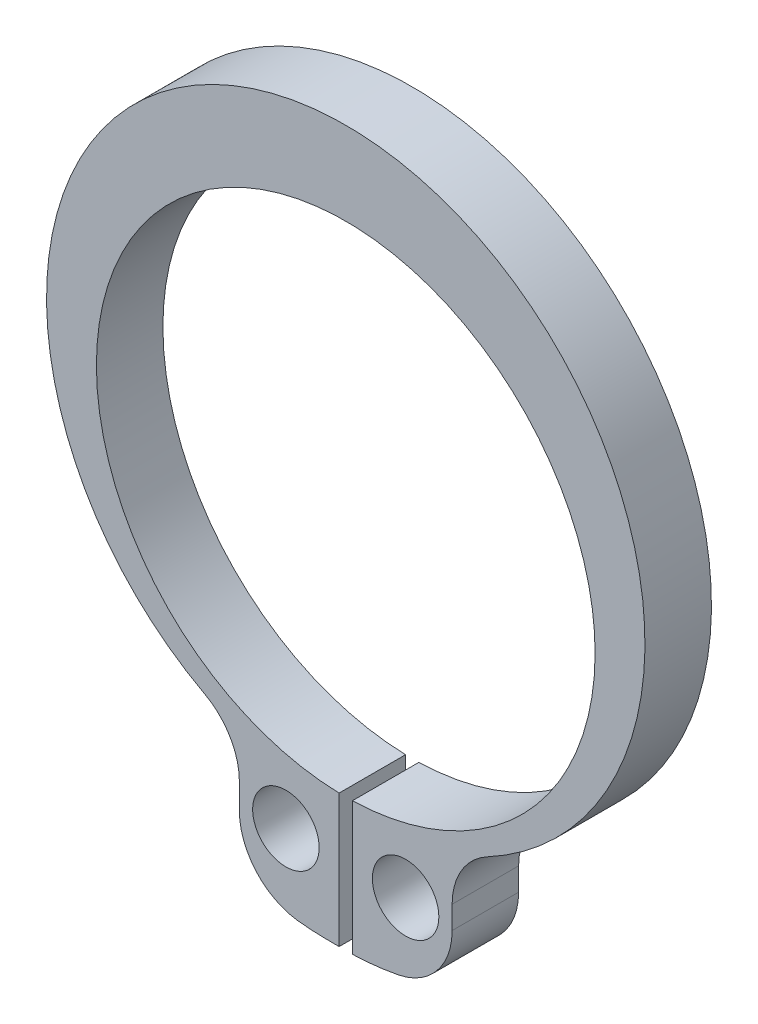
from build123d import *

# Parameters (mm, degrees)
EXTRUSION1_DEPTH        = 1
ESQUISSE2_R             = 0.5
ENL_V_MAT_EXTRU_1_DEPTH = 1
CONG_1_R                = 1


with BuildPart() as part:
    # Esquisse1 → Extrusion1 (new body)
    with BuildSketch(Plane.XY):
        with BuildLine():
            Line((-0.1, -3.74866643), (-0.1, -5.74866643))
            add(Edge.make_bspline(
                [(-1.6, -5.438181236), (-1.378929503, -5.535573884), (-0.90211363, -5.745635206), (-0.380026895, -5.747608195), (-0.1, -5.74866643)],
                knots=[0, 0, 0, 0, 0.46363913, 1, 1, 1, 1], degree=3))
            Line((-1.6, -5.438181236), (-1.6, -3.705948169))
            ThreePointArc((-1.6, -3.705948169), (0, 5), (1.6, -3.705948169))
            Line((1.6, -3.705948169), (1.6, -5.423642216))
            ThreePointArc((1.6, -5.423642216), (0.865091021, -5.655800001), (0.1, -5.74866643))
            Line((0.1, -5.74866643), (0.1, -3.74866643))
            ThreePointArc((0.1, -3.74866643), (0, 3.75), (-0.1, -3.74866643))
        make_face()
    extrude(amount=EXTRUSION1_DEPTH)

    # Esquisse2 → Enl_v. mat.-Extru.1 (cut)
    with BuildSketch(Plane.XY.offset(1)):
        with Locations((-0.9, -4.610827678)):
            Circle(ESQUISSE2_R)
        with Locations((0.9, -4.610827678)):
            Circle(ESQUISSE2_R)
    extrude(amount=-ENL_V_MAT_EXTRU_1_DEPTH, mode=Mode.SUBTRACT)

    # Cong_1
    cong_1_edges = [part.edges().sort_by_distance(p)[0] for p in [
        (1.6, -5.423642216, 0.5),
        (-1.6, -5.438181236, 0.5),
        (-1.6, -3.705948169, 0.5),
        (1.6, -3.705948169, 0.5),
    ]]
    fillet(cong_1_edges, radius=CONG_1_R)


solid = part.part
